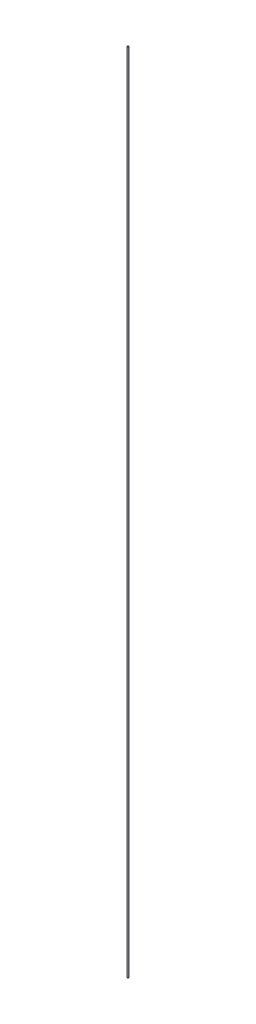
from build123d import *

# Parameters (mm, degrees)
ESQUISSE1_R      = 1.5
EXTRUSION1_DEPTH = 1880


with BuildPart() as part:
    # Esquisse1 → Extrusion1 (new body)
    with BuildSketch(Plane(origin=(0, 0, 0), x_dir=(1, 0, 0), z_dir=(0, 1, 0))):
        with Locations(Location((0, 0, 0), (0, 0, 90))):
            Circle(ESQUISSE1_R)
    extrude(amount=EXTRUSION1_DEPTH)


solid = part.part
